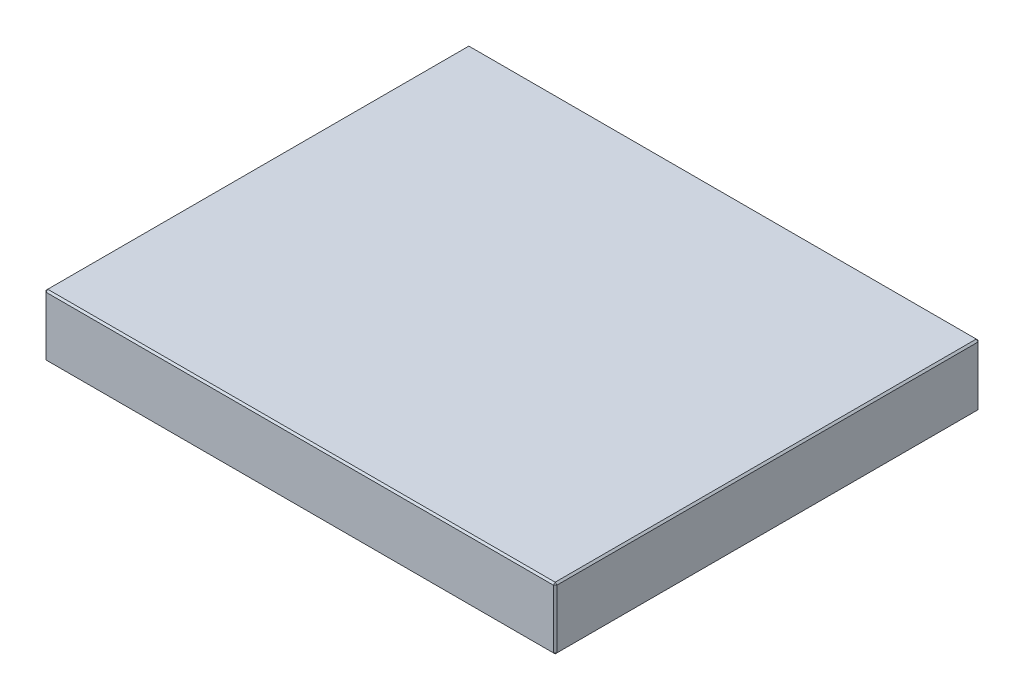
ISO-10303-21;
HEADER;
FILE_DESCRIPTION(('STEP AP214'),'2;1');
FILE_NAME('part.step','',(''),(''),'','','');
FILE_SCHEMA(('AUTOMOTIVE_DESIGN { 1 0 10303 214 1 1 1 1 }'));
ENDSEC;
DATA;
#1=APPLICATION_CONTEXT('core data for automotive mechanical design processes');
#2=APPLICATION_PROTOCOL_DEFINITION('international standard','automotive_design',2000,#1);
#3=PRODUCT_CONTEXT('',#1,'mechanical');
#4=PRODUCT('Part','Part','',(#3));
#5=PRODUCT_RELATED_PRODUCT_CATEGORY('part','',(#4));
#6=PRODUCT_DEFINITION_FORMATION('','',#4);
#7=PRODUCT_DEFINITION_CONTEXT('part definition',#1,'design');
#8=PRODUCT_DEFINITION('design','',#6,#7);
#9=PRODUCT_DEFINITION_SHAPE('','',#8);
#10=(LENGTH_UNIT() NAMED_UNIT(*) SI_UNIT(.MILLI.,.METRE.));
#11=(NAMED_UNIT(*) PLANE_ANGLE_UNIT() SI_UNIT($,.RADIAN.));
#12=(NAMED_UNIT(*) SI_UNIT($,.STERADIAN.) SOLID_ANGLE_UNIT());
#13=UNCERTAINTY_MEASURE_WITH_UNIT(LENGTH_MEASURE(1.E-05),#10,'distance_accuracy_value','');
#14=(GEOMETRIC_REPRESENTATION_CONTEXT(3) GLOBAL_UNCERTAINTY_ASSIGNED_CONTEXT((#13)) GLOBAL_UNIT_ASSIGNED_CONTEXT((#10,
#11,#12)) REPRESENTATION_CONTEXT('',''));
#15=CARTESIAN_POINT('',(0.,0.,0.));
#16=DIRECTION('',(0.,0.,1.));
#17=DIRECTION('',(1.,0.,0.));
#18=AXIS2_PLACEMENT_3D('',#15,#16,#17);
#19=CARTESIAN_POINT('',(-148.,36.,123.));
#20=DIRECTION('',(1.,0.,0.));
#21=DIRECTION('',(0.,0.,-1.));
#22=AXIS2_PLACEMENT_3D('',#19,#20,#21);
#23=PLANE('',#22);
#24=DIRECTION('',(0.,-1.,0.));
#25=VECTOR('',#24,1.);
#26=CARTESIAN_POINT('',(-148.,36.,-122.));
#27=LINE('',#26,#25);
#28=CARTESIAN_POINT('',(-148.,35.,-122.));
#29=VERTEX_POINT('',#28);
#30=CARTESIAN_POINT('',(-148.,1.,-122.));
#31=VERTEX_POINT('',#30);
#32=EDGE_CURVE('E115',#29,#31,#27,.T.);
#33=ORIENTED_EDGE('',*,*,#32,.T.);
#34=DIRECTION('',(0.,0.,1.));
#35=VECTOR('',#34,1.);
#36=CARTESIAN_POINT('',(-148.,1.,123.));
#37=LINE('',#36,#35);
#38=CARTESIAN_POINT('',(-148.,1.,122.));
#39=VERTEX_POINT('',#38);
#40=EDGE_CURVE('E111',#31,#39,#37,.T.);
#41=ORIENTED_EDGE('',*,*,#40,.T.);
#42=DIRECTION('',(0.,1.,0.));
#43=VECTOR('',#42,1.);
#44=CARTESIAN_POINT('',(-148.,36.,122.));
#45=LINE('',#44,#43);
#46=CARTESIAN_POINT('',(-148.,35.,122.));
#47=VERTEX_POINT('',#46);
#48=EDGE_CURVE('E104',#39,#47,#45,.T.);
#49=ORIENTED_EDGE('',*,*,#48,.T.);
#50=DIRECTION('',(0.,0.,-1.));
#51=VECTOR('',#50,1.);
#52=CARTESIAN_POINT('',(-148.,35.,-123.));
#53=LINE('',#52,#51);
#54=EDGE_CURVE('E108',#47,#29,#53,.T.);
#55=ORIENTED_EDGE('',*,*,#54,.T.);
#56=EDGE_LOOP('',(#33,#41,#49,#55));
#57=FACE_BOUND('',#56,.T.);
#58=ADVANCED_FACE('F16',(#57),#23,.F.);
#59=CARTESIAN_POINT('',(148.,36.,123.));
#60=DIRECTION('',(0.,0.,-1.));
#61=DIRECTION('',(-1.,0.,0.));
#62=AXIS2_PLACEMENT_3D('',#59,#60,#61);
#63=PLANE('',#62);
#64=DIRECTION('',(-1.,0.,0.));
#65=VECTOR('',#64,1.);
#66=CARTESIAN_POINT('',(-148.,35.,123.));
#67=LINE('',#66,#65);
#68=CARTESIAN_POINT('',(147.,35.,123.));
#69=VERTEX_POINT('',#68);
#70=CARTESIAN_POINT('',(-147.,35.,123.));
#71=VERTEX_POINT('',#70);
#72=EDGE_CURVE('E165',#69,#71,#67,.T.);
#73=ORIENTED_EDGE('',*,*,#72,.T.);
#74=DIRECTION('',(0.,-1.,0.));
#75=VECTOR('',#74,1.);
#76=CARTESIAN_POINT('',(-147.,36.,123.));
#77=LINE('',#76,#75);
#78=CARTESIAN_POINT('',(-147.,1.,123.));
#79=VERTEX_POINT('',#78);
#80=EDGE_CURVE('E123',#71,#79,#77,.T.);
#81=ORIENTED_EDGE('',*,*,#80,.T.);
#82=DIRECTION('',(1.,0.,0.));
#83=VECTOR('',#82,1.);
#84=CARTESIAN_POINT('',(148.,1.,123.));
#85=LINE('',#84,#83);
#86=CARTESIAN_POINT('',(147.,1.,123.));
#87=VERTEX_POINT('',#86);
#88=EDGE_CURVE('E169',#79,#87,#85,.T.);
#89=ORIENTED_EDGE('',*,*,#88,.T.);
#90=DIRECTION('',(0.,1.,0.));
#91=VECTOR('',#90,1.);
#92=CARTESIAN_POINT('',(147.,36.,123.));
#93=LINE('',#92,#91);
#94=EDGE_CURVE('E167',#87,#69,#93,.T.);
#95=ORIENTED_EDGE('',*,*,#94,.T.);
#96=EDGE_LOOP('',(#73,#81,#89,#95));
#97=FACE_BOUND('',#96,.T.);
#98=ADVANCED_FACE('F276',(#97),#63,.F.);
#99=CARTESIAN_POINT('',(148.,36.,123.));
#100=DIRECTION('',(-1.,0.,0.));
#101=DIRECTION('',(0.,0.,1.));
#102=AXIS2_PLACEMENT_3D('',#99,#100,#101);
#103=PLANE('',#102);
#104=DIRECTION('',(0.,0.,-1.));
#105=VECTOR('',#104,1.);
#106=CARTESIAN_POINT('',(148.,1.,123.));
#107=LINE('',#106,#105);
#108=CARTESIAN_POINT('',(148.,1.,122.));
#109=VERTEX_POINT('',#108);
#110=CARTESIAN_POINT('',(148.,1.,-122.));
#111=VERTEX_POINT('',#110);
#112=EDGE_CURVE('E160',#109,#111,#107,.T.);
#113=ORIENTED_EDGE('',*,*,#112,.T.);
#114=DIRECTION('',(0.,1.,0.));
#115=VECTOR('',#114,1.);
#116=CARTESIAN_POINT('',(148.,36.,-122.));
#117=LINE('',#116,#115);
#118=CARTESIAN_POINT('',(148.,35.,-122.));
#119=VERTEX_POINT('',#118);
#120=EDGE_CURVE('E162',#111,#119,#117,.T.);
#121=ORIENTED_EDGE('',*,*,#120,.T.);
#122=DIRECTION('',(0.,0.,1.));
#123=VECTOR('',#122,1.);
#124=CARTESIAN_POINT('',(148.,35.,123.));
#125=LINE('',#124,#123);
#126=CARTESIAN_POINT('',(148.,35.,122.));
#127=VERTEX_POINT('',#126);
#128=EDGE_CURVE('E156',#119,#127,#125,.T.);
#129=ORIENTED_EDGE('',*,*,#128,.T.);
#130=DIRECTION('',(0.,-1.,0.));
#131=VECTOR('',#130,1.);
#132=CARTESIAN_POINT('',(148.,36.,122.));
#133=LINE('',#132,#131);
#134=EDGE_CURVE('E158',#127,#109,#133,.T.);
#135=ORIENTED_EDGE('',*,*,#134,.T.);
#136=EDGE_LOOP('',(#113,#121,#129,#135));
#137=FACE_BOUND('',#136,.T.);
#138=ADVANCED_FACE('F255',(#137),#103,.F.);
#139=CARTESIAN_POINT('',(148.,36.,-123.));
#140=DIRECTION('',(0.,0.,1.));
#141=DIRECTION('',(1.,0.,0.));
#142=AXIS2_PLACEMENT_3D('',#139,#140,#141);
#143=PLANE('',#142);
#144=DIRECTION('',(0.,-1.,0.));
#145=VECTOR('',#144,1.);
#146=CARTESIAN_POINT('',(147.,36.,-123.));
#147=LINE('',#146,#145);
#148=CARTESIAN_POINT('',(147.,35.,-123.));
#149=VERTEX_POINT('',#148);
#150=CARTESIAN_POINT('',(147.,1.,-123.));
#151=VERTEX_POINT('',#150);
#152=EDGE_CURVE('E149',#149,#151,#147,.T.);
#153=ORIENTED_EDGE('',*,*,#152,.T.);
#154=DIRECTION('',(-1.,0.,0.));
#155=VECTOR('',#154,1.);
#156=CARTESIAN_POINT('',(148.,1.,-123.));
#157=LINE('',#156,#155);
#158=CARTESIAN_POINT('',(-147.,1.,-123.));
#159=VERTEX_POINT('',#158);
#160=EDGE_CURVE('E154',#151,#159,#157,.T.);
#161=ORIENTED_EDGE('',*,*,#160,.T.);
#162=DIRECTION('',(0.,1.,0.));
#163=VECTOR('',#162,1.);
#164=CARTESIAN_POINT('',(-147.,36.,-123.));
#165=LINE('',#164,#163);
#166=CARTESIAN_POINT('',(-147.,35.,-123.));
#167=VERTEX_POINT('',#166);
#168=EDGE_CURVE('E151',#159,#167,#165,.T.);
#169=ORIENTED_EDGE('',*,*,#168,.T.);
#170=DIRECTION('',(1.,0.,0.));
#171=VECTOR('',#170,1.);
#172=CARTESIAN_POINT('',(148.,35.,-123.));
#173=LINE('',#172,#171);
#174=EDGE_CURVE('E147',#167,#149,#173,.T.);
#175=ORIENTED_EDGE('',*,*,#174,.T.);
#176=EDGE_LOOP('',(#153,#161,#169,#175));
#177=FACE_BOUND('',#176,.T.);
#178=ADVANCED_FACE('F285',(#177),#143,.F.);
#179=CARTESIAN_POINT('',(0.,36.,0.));
#180=DIRECTION('',(0.,1.,0.));
#181=DIRECTION('',(0.,0.,1.));
#182=AXIS2_PLACEMENT_3D('',#179,#180,#181);
#183=PLANE('',#182);
#184=DIRECTION('',(0.,0.,-1.));
#185=VECTOR('',#184,1.);
#186=CARTESIAN_POINT('',(147.,36.,-123.));
#187=LINE('',#186,#185);
#188=CARTESIAN_POINT('',(147.,36.,122.));
#189=VERTEX_POINT('',#188);
#190=CARTESIAN_POINT('',(147.,36.,-122.));
#191=VERTEX_POINT('',#190);
#192=EDGE_CURVE('E25',#189,#191,#187,.T.);
#193=ORIENTED_EDGE('',*,*,#192,.T.);
#194=DIRECTION('',(-1.,0.,0.));
#195=VECTOR('',#194,1.);
#196=CARTESIAN_POINT('',(-148.,36.,-122.));
#197=LINE('',#196,#195);
#198=CARTESIAN_POINT('',(-147.,36.,-122.));
#199=VERTEX_POINT('',#198);
#200=EDGE_CURVE('E10',#191,#199,#197,.T.);
#201=ORIENTED_EDGE('',*,*,#200,.T.);
#202=DIRECTION('',(0.,0.,1.));
#203=VECTOR('',#202,1.);
#204=CARTESIAN_POINT('',(-147.,36.,123.));
#205=LINE('',#204,#203);
#206=CARTESIAN_POINT('',(-147.,36.,122.));
#207=VERTEX_POINT('',#206);
#208=EDGE_CURVE('E181',#199,#207,#205,.T.);
#209=ORIENTED_EDGE('',*,*,#208,.T.);
#210=DIRECTION('',(1.,0.,0.));
#211=VECTOR('',#210,1.);
#212=CARTESIAN_POINT('',(148.,36.,122.));
#213=LINE('',#212,#211);
#214=EDGE_CURVE('E36',#207,#189,#213,.T.);
#215=ORIENTED_EDGE('',*,*,#214,.T.);
#216=EDGE_LOOP('',(#193,#201,#209,#215));
#217=FACE_BOUND('',#216,.T.);
#218=ADVANCED_FACE('F351',(#217),#183,.T.);
#219=CARTESIAN_POINT('',(0.,0.,0.));
#220=DIRECTION('',(0.,1.,0.));
#221=DIRECTION('',(0.,0.,1.));
#222=AXIS2_PLACEMENT_3D('',#219,#220,#221);
#223=PLANE('',#222);
#224=DIRECTION('',(0.,0.,1.));
#225=VECTOR('',#224,1.);
#226=CARTESIAN_POINT('',(147.,0.,0.));
#227=LINE('',#226,#225);
#228=CARTESIAN_POINT('',(147.,0.,-122.));
#229=VERTEX_POINT('',#228);
#230=CARTESIAN_POINT('',(147.,0.,122.));
#231=VERTEX_POINT('',#230);
#232=EDGE_CURVE('E172',#229,#231,#227,.T.);
#233=ORIENTED_EDGE('',*,*,#232,.T.);
#234=DIRECTION('',(-1.,0.,0.));
#235=VECTOR('',#234,1.);
#236=CARTESIAN_POINT('',(0.,0.,122.));
#237=LINE('',#236,#235);
#238=CARTESIAN_POINT('',(-147.,0.,122.));
#239=VERTEX_POINT('',#238);
#240=EDGE_CURVE('E178',#231,#239,#237,.T.);
#241=ORIENTED_EDGE('',*,*,#240,.T.);
#242=DIRECTION('',(0.,0.,-1.));
#243=VECTOR('',#242,1.);
#244=CARTESIAN_POINT('',(-147.,0.,0.));
#245=LINE('',#244,#243);
#246=CARTESIAN_POINT('',(-147.,0.,-122.));
#247=VERTEX_POINT('',#246);
#248=EDGE_CURVE('E176',#239,#247,#245,.T.);
#249=ORIENTED_EDGE('',*,*,#248,.T.);
#250=DIRECTION('',(1.,0.,0.));
#251=VECTOR('',#250,1.);
#252=CARTESIAN_POINT('',(0.,0.,-122.));
#253=LINE('',#252,#251);
#254=EDGE_CURVE('E174',#247,#229,#253,.T.);
#255=ORIENTED_EDGE('',*,*,#254,.T.);
#256=EDGE_LOOP('',(#233,#241,#249,#255));
#257=FACE_BOUND('',#256,.T.);
#258=ADVANCED_FACE('F247',(#257),#223,.F.);
#259=CARTESIAN_POINT('',(148.,36.,122.));
#260=DIRECTION('',(-0.707106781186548,0.,-0.707106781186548));
#261=DIRECTION('',(0.,-1.,0.));
#262=AXIS2_PLACEMENT_3D('',#259,#260,#261);
#263=PLANE('',#262);
#264=DIRECTION('',(-0.707106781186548,0.,0.707106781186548));
#265=VECTOR('',#264,1.);
#266=CARTESIAN_POINT('',(147.,35.,123.));
#267=LINE('',#266,#265);
#268=EDGE_CURVE('E20',#69,#127,#267,.F.);
#269=ORIENTED_EDGE('',*,*,#268,.F.);
#270=ORIENTED_EDGE('',*,*,#94,.F.);
#271=DIRECTION('',(0.707106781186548,0.,-0.707106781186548));
#272=VECTOR('',#271,1.);
#273=CARTESIAN_POINT('',(147.,1.,123.));
#274=LINE('',#273,#272);
#275=EDGE_CURVE('E143',#109,#87,#274,.F.);
#276=ORIENTED_EDGE('',*,*,#275,.F.);
#277=ORIENTED_EDGE('',*,*,#134,.F.);
#278=EDGE_LOOP('',(#269,#270,#276,#277));
#279=FACE_BOUND('',#278,.T.);
#280=ADVANCED_FACE('F18',(#279),#263,.F.);
#281=CARTESIAN_POINT('',(147.,35.,123.));
#282=DIRECTION('',(0.577350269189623,0.577350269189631,0.577350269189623));
#283=DIRECTION('',(0.,-0.707106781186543,0.707106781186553));
#284=AXIS2_PLACEMENT_3D('',#281,#282,#283);
#285=PLANE('',#284);
#286=DIRECTION('',(0.,-0.70710678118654,0.707106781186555));
#287=VECTOR('',#286,1.);
#288=CARTESIAN_POINT('',(147.,35.,123.));
#289=LINE('',#288,#287);
#290=EDGE_CURVE('E227',#69,#189,#289,.F.);
#291=ORIENTED_EDGE('',*,*,#290,.F.);
#292=ORIENTED_EDGE('',*,*,#268,.T.);
#293=DIRECTION('',(-0.707106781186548,0.707106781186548,0.));
#294=VECTOR('',#293,1.);
#295=CARTESIAN_POINT('',(147.5,35.5,122.));
#296=LINE('',#295,#294);
#297=EDGE_CURVE('E229',#189,#127,#296,.F.);
#298=ORIENTED_EDGE('',*,*,#297,.F.);
#299=EDGE_LOOP('',(#291,#292,#298));
#300=FACE_BOUND('',#299,.T.);
#301=ADVANCED_FACE('F271',(#300),#285,.T.);
#302=CARTESIAN_POINT('',(147.,1.,123.));
#303=DIRECTION('',(0.577350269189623,-0.577350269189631,0.577350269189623));
#304=DIRECTION('',(0.,-0.707106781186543,-0.707106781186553));
#305=AXIS2_PLACEMENT_3D('',#302,#303,#304);
#306=PLANE('',#305);
#307=DIRECTION('',(-0.707106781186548,-0.707106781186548,0.));
#308=VECTOR('',#307,1.);
#309=CARTESIAN_POINT('',(147.5,0.500000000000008,122.));
#310=LINE('',#309,#308);
#311=EDGE_CURVE('E221',#109,#231,#310,.T.);
#312=ORIENTED_EDGE('',*,*,#311,.F.);
#313=ORIENTED_EDGE('',*,*,#275,.T.);
#314=DIRECTION('',(0.,0.70710678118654,0.707106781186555));
#315=VECTOR('',#314,1.);
#316=CARTESIAN_POINT('',(147.,1.,123.));
#317=LINE('',#316,#315);
#318=EDGE_CURVE('E224',#231,#87,#317,.T.);
#319=ORIENTED_EDGE('',*,*,#318,.F.);
#320=EDGE_LOOP('',(#312,#313,#319));
#321=FACE_BOUND('',#320,.T.);
#322=ADVANCED_FACE('F236',(#321),#306,.T.);
#323=CARTESIAN_POINT('',(147.,36.,0.));
#324=DIRECTION('',(0.707106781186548,0.707106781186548,0.));
#325=DIRECTION('',(0.,0.,1.));
#326=AXIS2_PLACEMENT_3D('',#323,#324,#325);
#327=PLANE('',#326);
#328=ORIENTED_EDGE('',*,*,#297,.T.);
#329=ORIENTED_EDGE('',*,*,#128,.F.);
#330=DIRECTION('',(0.707106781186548,-0.707106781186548,0.));
#331=VECTOR('',#330,1.);
#332=CARTESIAN_POINT('',(148.,35.,-122.));
#333=LINE('',#332,#331);
#334=EDGE_CURVE('E216',#191,#119,#333,.T.);
#335=ORIENTED_EDGE('',*,*,#334,.F.);
#336=ORIENTED_EDGE('',*,*,#192,.F.);
#337=EDGE_LOOP('',(#328,#329,#335,#336));
#338=FACE_BOUND('',#337,.T.);
#339=ADVANCED_FACE('F266',(#338),#327,.T.);
#340=CARTESIAN_POINT('',(0.,36.,122.));
#341=DIRECTION('',(0.,0.707106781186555,0.70710678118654));
#342=DIRECTION('',(-1.,0.,0.));
#343=AXIS2_PLACEMENT_3D('',#340,#341,#342);
#344=PLANE('',#343);
#345=ORIENTED_EDGE('',*,*,#290,.T.);
#346=ORIENTED_EDGE('',*,*,#214,.F.);
#347=DIRECTION('',(0.,0.70710678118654,-0.707106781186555));
#348=VECTOR('',#347,1.);
#349=CARTESIAN_POINT('',(-147.,35.5,122.5));
#350=LINE('',#349,#348);
#351=EDGE_CURVE('E127',#71,#207,#350,.T.);
#352=ORIENTED_EDGE('',*,*,#351,.F.);
#353=ORIENTED_EDGE('',*,*,#72,.F.);
#354=EDGE_LOOP('',(#345,#346,#352,#353));
#355=FACE_BOUND('',#354,.T.);
#356=ADVANCED_FACE('F274',(#355),#344,.T.);
#357=CARTESIAN_POINT('',(-147.,36.,123.));
#358=DIRECTION('',(0.707106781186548,0.,-0.707106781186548));
#359=DIRECTION('',(0.,-1.,0.));
#360=AXIS2_PLACEMENT_3D('',#357,#358,#359);
#361=PLANE('',#360);
#362=DIRECTION('',(0.707106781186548,0.,0.707106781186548));
#363=VECTOR('',#362,1.);
#364=CARTESIAN_POINT('',(-147.,1.,123.));
#365=LINE('',#364,#363);
#366=EDGE_CURVE('E128',#79,#39,#365,.F.);
#367=ORIENTED_EDGE('',*,*,#366,.F.);
#368=ORIENTED_EDGE('',*,*,#80,.F.);
#369=DIRECTION('',(-0.707106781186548,0.,-0.707106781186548));
#370=VECTOR('',#369,1.);
#371=CARTESIAN_POINT('',(-148.,35.,122.));
#372=LINE('',#371,#370);
#373=EDGE_CURVE('E119',#47,#71,#372,.F.);
#374=ORIENTED_EDGE('',*,*,#373,.F.);
#375=ORIENTED_EDGE('',*,*,#48,.F.);
#376=EDGE_LOOP('',(#367,#368,#374,#375));
#377=FACE_BOUND('',#376,.T.);
#378=ADVANCED_FACE('F121',(#377),#361,.F.);
#379=CARTESIAN_POINT('',(148.,1.,123.));
#380=DIRECTION('',(0.,0.707106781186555,-0.70710678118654));
#381=DIRECTION('',(1.,0.,0.));
#382=AXIS2_PLACEMENT_3D('',#379,#380,#381);
#383=PLANE('',#382);
#384=ORIENTED_EDGE('',*,*,#318,.T.);
#385=ORIENTED_EDGE('',*,*,#88,.F.);
#386=DIRECTION('',(0.,-0.70710678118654,-0.707106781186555));
#387=VECTOR('',#386,1.);
#388=CARTESIAN_POINT('',(-147.,1.,123.));
#389=LINE('',#388,#387);
#390=EDGE_CURVE('E212',#239,#79,#389,.F.);
#391=ORIENTED_EDGE('',*,*,#390,.F.);
#392=ORIENTED_EDGE('',*,*,#240,.F.);
#393=EDGE_LOOP('',(#384,#385,#391,#392));
#394=FACE_BOUND('',#393,.T.);
#395=ADVANCED_FACE('F244',(#394),#383,.F.);
#396=CARTESIAN_POINT('',(148.,1.,123.));
#397=DIRECTION('',(-0.707106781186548,0.707106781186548,0.));
#398=DIRECTION('',(0.,0.,-1.));
#399=AXIS2_PLACEMENT_3D('',#396,#397,#398);
#400=PLANE('',#399);
#401=ORIENTED_EDGE('',*,*,#311,.T.);
#402=ORIENTED_EDGE('',*,*,#232,.F.);
#403=DIRECTION('',(0.707106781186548,0.707106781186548,0.));
#404=VECTOR('',#403,1.);
#405=CARTESIAN_POINT('',(147.5,0.499999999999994,-122.));
#406=LINE('',#405,#404);
#407=EDGE_CURVE('E209',#111,#229,#406,.F.);
#408=ORIENTED_EDGE('',*,*,#407,.F.);
#409=ORIENTED_EDGE('',*,*,#112,.F.);
#410=EDGE_LOOP('',(#401,#402,#408,#409));
#411=FACE_BOUND('',#410,.T.);
#412=ADVANCED_FACE('F252',(#411),#400,.F.);
#413=CARTESIAN_POINT('',(147.,36.,-123.));
#414=DIRECTION('',(-0.707106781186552,0.,0.707106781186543));
#415=DIRECTION('',(0.,-1.,0.));
#416=AXIS2_PLACEMENT_3D('',#413,#414,#415);
#417=PLANE('',#416);
#418=DIRECTION('',(0.707106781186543,0.,0.707106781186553));
#419=VECTOR('',#418,1.);
#420=CARTESIAN_POINT('',(148.,35.,-122.));
#421=LINE('',#420,#419);
#422=EDGE_CURVE('E218',#119,#149,#421,.F.);
#423=ORIENTED_EDGE('',*,*,#422,.F.);
#424=ORIENTED_EDGE('',*,*,#120,.F.);
#425=DIRECTION('',(-0.707106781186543,0.,-0.707106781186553));
#426=VECTOR('',#425,1.);
#427=CARTESIAN_POINT('',(147.,1.,-123.));
#428=LINE('',#427,#426);
#429=EDGE_CURVE('E206',#151,#111,#428,.F.);
#430=ORIENTED_EDGE('',*,*,#429,.F.);
#431=ORIENTED_EDGE('',*,*,#152,.F.);
#432=EDGE_LOOP('',(#423,#424,#430,#431));
#433=FACE_BOUND('',#432,.T.);
#434=ADVANCED_FACE('F259',(#433),#417,.F.);
#435=CARTESIAN_POINT('',(148.,35.,-122.));
#436=DIRECTION('',(0.577350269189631,0.577350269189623,-0.577350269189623));
#437=DIRECTION('',(-0.707106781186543,0.,-0.707106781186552));
#438=AXIS2_PLACEMENT_3D('',#435,#436,#437);
#439=PLANE('',#438);
#440=ORIENTED_EDGE('',*,*,#334,.T.);
#441=ORIENTED_EDGE('',*,*,#422,.T.);
#442=DIRECTION('',(0.,0.707106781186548,0.707106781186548));
#443=VECTOR('',#442,1.);
#444=CARTESIAN_POINT('',(147.,35.5,-122.5));
#445=LINE('',#444,#443);
#446=EDGE_CURVE('E135',#191,#149,#445,.F.);
#447=ORIENTED_EDGE('',*,*,#446,.F.);
#448=EDGE_LOOP('',(#440,#441,#447));
#449=FACE_BOUND('',#448,.T.);
#450=ADVANCED_FACE('F326',(#449),#439,.T.);
#451=CARTESIAN_POINT('',(-148.,35.,122.));
#452=DIRECTION('',(-0.577350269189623,0.577350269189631,0.577350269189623));
#453=DIRECTION('',(0.,-0.707106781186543,0.707106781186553));
#454=AXIS2_PLACEMENT_3D('',#451,#452,#453);
#455=PLANE('',#454);
#456=ORIENTED_EDGE('',*,*,#373,.T.);
#457=ORIENTED_EDGE('',*,*,#351,.T.);
#458=DIRECTION('',(-0.707106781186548,-0.707106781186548,0.));
#459=VECTOR('',#458,1.);
#460=CARTESIAN_POINT('',(-148.,35.,122.));
#461=LINE('',#460,#459);
#462=EDGE_CURVE('E131',#47,#207,#461,.F.);
#463=ORIENTED_EDGE('',*,*,#462,.F.);
#464=EDGE_LOOP('',(#456,#457,#463));
#465=FACE_BOUND('',#464,.T.);
#466=ADVANCED_FACE('F132',(#465),#455,.T.);
#467=CARTESIAN_POINT('',(-147.,1.,123.));
#468=DIRECTION('',(-0.577350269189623,-0.577350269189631,0.577350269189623));
#469=DIRECTION('',(0.,-0.707106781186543,-0.707106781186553));
#470=AXIS2_PLACEMENT_3D('',#467,#468,#469);
#471=PLANE('',#470);
#472=ORIENTED_EDGE('',*,*,#390,.T.);
#473=ORIENTED_EDGE('',*,*,#366,.T.);
#474=DIRECTION('',(-0.707106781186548,0.707106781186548,0.));
#475=VECTOR('',#474,1.);
#476=CARTESIAN_POINT('',(-147.5,0.500000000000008,122.));
#477=LINE('',#476,#475);
#478=EDGE_CURVE('E136',#239,#39,#477,.T.);
#479=ORIENTED_EDGE('',*,*,#478,.F.);
#480=EDGE_LOOP('',(#472,#473,#479));
#481=FACE_BOUND('',#480,.T.);
#482=ADVANCED_FACE('F319',(#481),#471,.T.);
#483=CARTESIAN_POINT('',(147.,1.,-123.));
#484=DIRECTION('',(0.577350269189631,-0.577350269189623,-0.577350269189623));
#485=DIRECTION('',(-0.707106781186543,0.,-0.707106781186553));
#486=AXIS2_PLACEMENT_3D('',#483,#484,#485);
#487=PLANE('',#486);
#488=ORIENTED_EDGE('',*,*,#429,.T.);
#489=ORIENTED_EDGE('',*,*,#407,.T.);
#490=DIRECTION('',(0.,-0.707106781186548,0.707106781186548));
#491=VECTOR('',#490,1.);
#492=CARTESIAN_POINT('',(147.,1.,-123.));
#493=LINE('',#492,#491);
#494=EDGE_CURVE('E199',#151,#229,#493,.T.);
#495=ORIENTED_EDGE('',*,*,#494,.F.);
#496=EDGE_LOOP('',(#488,#489,#495));
#497=FACE_BOUND('',#496,.T.);
#498=ADVANCED_FACE('F315',(#497),#487,.T.);
#499=CARTESIAN_POINT('',(0.,36.,-122.));
#500=DIRECTION('',(0.,0.707106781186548,-0.707106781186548));
#501=DIRECTION('',(1.,0.,0.));
#502=AXIS2_PLACEMENT_3D('',#499,#500,#501);
#503=PLANE('',#502);
#504=ORIENTED_EDGE('',*,*,#446,.T.);
#505=ORIENTED_EDGE('',*,*,#174,.F.);
#506=DIRECTION('',(0.,-0.707106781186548,-0.707106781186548));
#507=VECTOR('',#506,1.);
#508=CARTESIAN_POINT('',(-147.,35.,-123.));
#509=LINE('',#508,#507);
#510=EDGE_CURVE('E196',#199,#167,#509,.T.);
#511=ORIENTED_EDGE('',*,*,#510,.F.);
#512=ORIENTED_EDGE('',*,*,#200,.F.);
#513=EDGE_LOOP('',(#504,#505,#511,#512));
#514=FACE_BOUND('',#513,.T.);
#515=ADVANCED_FACE('F312',(#514),#503,.T.);
#516=CARTESIAN_POINT('',(-147.,36.,0.));
#517=DIRECTION('',(-0.707106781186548,0.707106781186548,0.));
#518=DIRECTION('',(0.,0.,-1.));
#519=AXIS2_PLACEMENT_3D('',#516,#517,#518);
#520=PLANE('',#519);
#521=ORIENTED_EDGE('',*,*,#462,.T.);
#522=ORIENTED_EDGE('',*,*,#208,.F.);
#523=DIRECTION('',(0.707106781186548,0.707106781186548,0.));
#524=VECTOR('',#523,1.);
#525=CARTESIAN_POINT('',(-147.5,35.5,-122.));
#526=LINE('',#525,#524);
#527=EDGE_CURVE('E139',#29,#199,#526,.T.);
#528=ORIENTED_EDGE('',*,*,#527,.F.);
#529=ORIENTED_EDGE('',*,*,#54,.F.);
#530=EDGE_LOOP('',(#521,#522,#528,#529));
#531=FACE_BOUND('',#530,.T.);
#532=ADVANCED_FACE('F138',(#531),#520,.T.);
#533=CARTESIAN_POINT('',(-148.,1.,123.));
#534=DIRECTION('',(0.707106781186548,0.707106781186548,0.));
#535=DIRECTION('',(0.,0.,1.));
#536=AXIS2_PLACEMENT_3D('',#533,#534,#535);
#537=PLANE('',#536);
#538=ORIENTED_EDGE('',*,*,#478,.T.);
#539=ORIENTED_EDGE('',*,*,#40,.F.);
#540=DIRECTION('',(0.707106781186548,-0.707106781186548,0.));
#541=VECTOR('',#540,1.);
#542=CARTESIAN_POINT('',(-148.,1.,-122.));
#543=LINE('',#542,#541);
#544=EDGE_CURVE('E192',#247,#31,#543,.F.);
#545=ORIENTED_EDGE('',*,*,#544,.F.);
#546=ORIENTED_EDGE('',*,*,#248,.F.);
#547=EDGE_LOOP('',(#538,#539,#545,#546));
#548=FACE_BOUND('',#547,.T.);
#549=ADVANCED_FACE('F305',(#548),#537,.F.);
#550=CARTESIAN_POINT('',(148.,1.,-123.));
#551=DIRECTION('',(0.,0.707106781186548,0.707106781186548));
#552=DIRECTION('',(-1.,0.,0.));
#553=AXIS2_PLACEMENT_3D('',#550,#551,#552);
#554=PLANE('',#553);
#555=ORIENTED_EDGE('',*,*,#494,.T.);
#556=ORIENTED_EDGE('',*,*,#254,.F.);
#557=DIRECTION('',(0.,0.707106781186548,-0.707106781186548));
#558=VECTOR('',#557,1.);
#559=CARTESIAN_POINT('',(-147.,0.5,-122.5));
#560=LINE('',#559,#558);
#561=EDGE_CURVE('E189',#159,#247,#560,.F.);
#562=ORIENTED_EDGE('',*,*,#561,.F.);
#563=ORIENTED_EDGE('',*,*,#160,.F.);
#564=EDGE_LOOP('',(#555,#556,#562,#563));
#565=FACE_BOUND('',#564,.T.);
#566=ADVANCED_FACE('F301',(#565),#554,.F.);
#567=CARTESIAN_POINT('',(-147.,35.,-123.));
#568=DIRECTION('',(-0.577350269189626,0.577350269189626,-0.577350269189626));
#569=DIRECTION('',(-0.707106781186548,0.,0.707106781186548));
#570=AXIS2_PLACEMENT_3D('',#567,#568,#569);
#571=PLANE('',#570);
#572=ORIENTED_EDGE('',*,*,#527,.T.);
#573=ORIENTED_EDGE('',*,*,#510,.T.);
#574=DIRECTION('',(0.707106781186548,0.,-0.707106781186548));
#575=VECTOR('',#574,1.);
#576=CARTESIAN_POINT('',(-147.,35.,-123.));
#577=LINE('',#576,#575);
#578=EDGE_CURVE('E187',#29,#167,#577,.T.);
#579=ORIENTED_EDGE('',*,*,#578,.F.);
#580=EDGE_LOOP('',(#572,#573,#579));
#581=FACE_BOUND('',#580,.T.);
#582=ADVANCED_FACE('F297',(#581),#571,.T.);
#583=CARTESIAN_POINT('',(-148.,1.,-122.));
#584=DIRECTION('',(-0.577350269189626,-0.577350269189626,-0.577350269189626));
#585=DIRECTION('',(-0.707106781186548,0.,0.707106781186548));
#586=AXIS2_PLACEMENT_3D('',#583,#584,#585);
#587=PLANE('',#586);
#588=ORIENTED_EDGE('',*,*,#561,.T.);
#589=ORIENTED_EDGE('',*,*,#544,.T.);
#590=DIRECTION('',(-0.707106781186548,0.,0.707106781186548));
#591=VECTOR('',#590,1.);
#592=CARTESIAN_POINT('',(-148.,1.,-122.));
#593=LINE('',#592,#591);
#594=EDGE_CURVE('E185',#159,#31,#593,.T.);
#595=ORIENTED_EDGE('',*,*,#594,.F.);
#596=EDGE_LOOP('',(#588,#589,#595));
#597=FACE_BOUND('',#596,.T.);
#598=ADVANCED_FACE('F293',(#597),#587,.T.);
#599=CARTESIAN_POINT('',(-148.,36.,-122.));
#600=DIRECTION('',(0.707106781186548,0.,0.707106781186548));
#601=DIRECTION('',(0.,-1.,0.));
#602=AXIS2_PLACEMENT_3D('',#599,#600,#601);
#603=PLANE('',#602);
#604=ORIENTED_EDGE('',*,*,#578,.T.);
#605=ORIENTED_EDGE('',*,*,#168,.F.);
#606=ORIENTED_EDGE('',*,*,#594,.T.);
#607=ORIENTED_EDGE('',*,*,#32,.F.);
#608=EDGE_LOOP('',(#604,#605,#606,#607));
#609=FACE_BOUND('',#608,.T.);
#610=ADVANCED_FACE('F290',(#609),#603,.F.);
#611=CLOSED_SHELL('',(#58,#98,#138,#178,#218,#258,#280,#301,#322,#339,#356,#378,#395,#412,#434,
#450,#466,#482,#498,#515,#532,#549,#566,#582,#598,#610));
#612=MANIFOLD_SOLID_BREP('B1',#611);
#613=ADVANCED_BREP_SHAPE_REPRESENTATION('',(#18,#612),#14);
#614=SHAPE_DEFINITION_REPRESENTATION(#9,#613);
ENDSEC;
END-ISO-10303-21;
